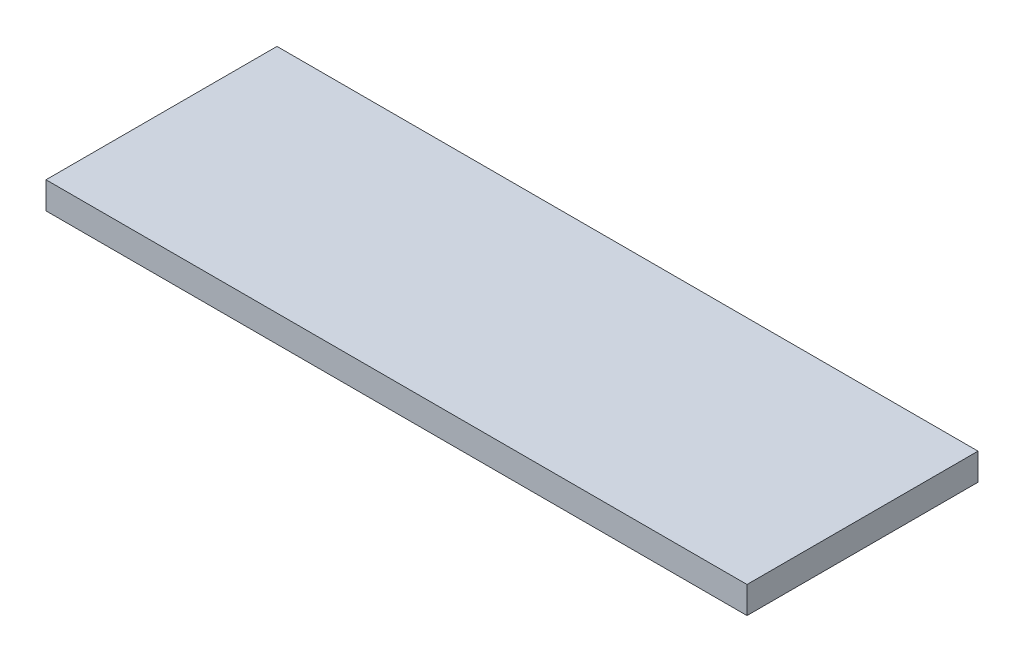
ISO-10303-21;
HEADER;
FILE_DESCRIPTION(('STEP AP214'),'2;1');
FILE_NAME('part.step','',(''),(''),'','','');
FILE_SCHEMA(('AUTOMOTIVE_DESIGN { 1 0 10303 214 1 1 1 1 }'));
ENDSEC;
DATA;
#1=APPLICATION_CONTEXT('core data for automotive mechanical design processes');
#2=APPLICATION_PROTOCOL_DEFINITION('international standard','automotive_design',2000,#1);
#3=PRODUCT_CONTEXT('',#1,'mechanical');
#4=PRODUCT('Part','Part','',(#3));
#5=PRODUCT_RELATED_PRODUCT_CATEGORY('part','',(#4));
#6=PRODUCT_DEFINITION_FORMATION('','',#4);
#7=PRODUCT_DEFINITION_CONTEXT('part definition',#1,'design');
#8=PRODUCT_DEFINITION('design','',#6,#7);
#9=PRODUCT_DEFINITION_SHAPE('','',#8);
#10=(LENGTH_UNIT() NAMED_UNIT(*) SI_UNIT(.MILLI.,.METRE.));
#11=(NAMED_UNIT(*) PLANE_ANGLE_UNIT() SI_UNIT($,.RADIAN.));
#12=(NAMED_UNIT(*) SI_UNIT($,.STERADIAN.) SOLID_ANGLE_UNIT());
#13=UNCERTAINTY_MEASURE_WITH_UNIT(LENGTH_MEASURE(1.E-05),#10,'distance_accuracy_value','');
#14=(GEOMETRIC_REPRESENTATION_CONTEXT(3) GLOBAL_UNCERTAINTY_ASSIGNED_CONTEXT((#13)) GLOBAL_UNIT_ASSIGNED_CONTEXT((#10,
#11,#12)) REPRESENTATION_CONTEXT('',''));
#15=CARTESIAN_POINT('',(0.,0.,0.));
#16=DIRECTION('',(0.,0.,1.));
#17=DIRECTION('',(1.,0.,0.));
#18=AXIS2_PLACEMENT_3D('',#15,#16,#17);
#19=CARTESIAN_POINT('',(0.,6.35,0.));
#20=DIRECTION('',(1.,0.,0.));
#21=DIRECTION('',(0.,0.,-1.));
#22=AXIS2_PLACEMENT_3D('',#19,#20,#21);
#23=PLANE('',#22);
#24=DIRECTION('',(0.,0.,1.));
#25=VECTOR('',#24,1.);
#26=CARTESIAN_POINT('',(0.,0.,0.));
#27=LINE('',#26,#25);
#28=CARTESIAN_POINT('',(0.,0.,-54.4));
#29=VERTEX_POINT('',#28);
#30=CARTESIAN_POINT('',(0.,0.,0.));
#31=VERTEX_POINT('',#30);
#32=EDGE_CURVE('E105',#29,#31,#27,.T.);
#33=ORIENTED_EDGE('',*,*,#32,.T.);
#34=DIRECTION('',(0.,-1.,0.));
#35=VECTOR('',#34,1.);
#36=CARTESIAN_POINT('',(0.,6.35,0.));
#37=LINE('',#36,#35);
#38=CARTESIAN_POINT('',(0.,6.35,0.));
#39=VERTEX_POINT('',#38);
#40=EDGE_CURVE('E11',#39,#31,#37,.T.);
#41=ORIENTED_EDGE('',*,*,#40,.F.);
#42=DIRECTION('',(0.,0.,1.));
#43=VECTOR('',#42,1.);
#44=CARTESIAN_POINT('',(0.,6.35,0.));
#45=LINE('',#44,#43);
#46=CARTESIAN_POINT('',(0.,6.35,-54.4));
#47=VERTEX_POINT('',#46);
#48=EDGE_CURVE('E89',#47,#39,#45,.T.);
#49=ORIENTED_EDGE('',*,*,#48,.F.);
#50=DIRECTION('',(0.,-1.,0.));
#51=VECTOR('',#50,1.);
#52=CARTESIAN_POINT('',(0.,6.35,-54.4));
#53=LINE('',#52,#51);
#54=EDGE_CURVE('E97',#47,#29,#53,.T.);
#55=ORIENTED_EDGE('',*,*,#54,.T.);
#56=EDGE_LOOP('',(#33,#41,#49,#55));
#57=FACE_BOUND('',#56,.T.);
#58=ADVANCED_FACE('F39',(#57),#23,.F.);
#59=CARTESIAN_POINT('',(0.,6.35,0.));
#60=DIRECTION('',(0.,0.,-1.));
#61=DIRECTION('',(-1.,0.,0.));
#62=AXIS2_PLACEMENT_3D('',#59,#60,#61);
#63=PLANE('',#62);
#64=DIRECTION('',(1.,0.,0.));
#65=VECTOR('',#64,1.);
#66=CARTESIAN_POINT('',(0.,0.,0.));
#67=LINE('',#66,#65);
#68=CARTESIAN_POINT('',(165.1,0.,0.));
#69=VERTEX_POINT('',#68);
#70=EDGE_CURVE('E92',#31,#69,#67,.T.);
#71=ORIENTED_EDGE('',*,*,#70,.T.);
#72=DIRECTION('',(0.,-1.,0.));
#73=VECTOR('',#72,1.);
#74=CARTESIAN_POINT('',(165.1,6.35,0.));
#75=LINE('',#74,#73);
#76=CARTESIAN_POINT('',(165.1,6.35,0.));
#77=VERTEX_POINT('',#76);
#78=EDGE_CURVE('E50',#77,#69,#75,.T.);
#79=ORIENTED_EDGE('',*,*,#78,.F.);
#80=DIRECTION('',(1.,0.,0.));
#81=VECTOR('',#80,1.);
#82=CARTESIAN_POINT('',(0.,6.35,0.));
#83=LINE('',#82,#81);
#84=EDGE_CURVE('E82',#39,#77,#83,.T.);
#85=ORIENTED_EDGE('',*,*,#84,.F.);
#86=ORIENTED_EDGE('',*,*,#40,.T.);
#87=EDGE_LOOP('',(#71,#79,#85,#86));
#88=FACE_BOUND('',#87,.T.);
#89=ADVANCED_FACE('F93',(#88),#63,.F.);
#90=CARTESIAN_POINT('',(165.1,6.35,0.));
#91=DIRECTION('',(-1.,0.,0.));
#92=DIRECTION('',(0.,0.,1.));
#93=AXIS2_PLACEMENT_3D('',#90,#91,#92);
#94=PLANE('',#93);
#95=DIRECTION('',(0.,0.,-1.));
#96=VECTOR('',#95,1.);
#97=CARTESIAN_POINT('',(165.1,0.,0.));
#98=LINE('',#97,#96);
#99=CARTESIAN_POINT('',(165.1,0.,-54.4));
#100=VERTEX_POINT('',#99);
#101=EDGE_CURVE('E72',#69,#100,#98,.T.);
#102=ORIENTED_EDGE('',*,*,#101,.T.);
#103=DIRECTION('',(0.,-1.,0.));
#104=VECTOR('',#103,1.);
#105=CARTESIAN_POINT('',(165.1,6.35,-54.4));
#106=LINE('',#105,#104);
#107=CARTESIAN_POINT('',(165.1,6.35,-54.4));
#108=VERTEX_POINT('',#107);
#109=EDGE_CURVE('E94',#108,#100,#106,.T.);
#110=ORIENTED_EDGE('',*,*,#109,.F.);
#111=DIRECTION('',(0.,0.,-1.));
#112=VECTOR('',#111,1.);
#113=CARTESIAN_POINT('',(165.1,6.35,0.));
#114=LINE('',#113,#112);
#115=EDGE_CURVE('E88',#77,#108,#114,.T.);
#116=ORIENTED_EDGE('',*,*,#115,.F.);
#117=ORIENTED_EDGE('',*,*,#78,.T.);
#118=EDGE_LOOP('',(#102,#110,#116,#117));
#119=FACE_BOUND('',#118,.T.);
#120=ADVANCED_FACE('F96',(#119),#94,.F.);
#121=CARTESIAN_POINT('',(0.,6.35,-54.4));
#122=DIRECTION('',(0.,0.,1.));
#123=DIRECTION('',(1.,0.,0.));
#124=AXIS2_PLACEMENT_3D('',#121,#122,#123);
#125=PLANE('',#124);
#126=DIRECTION('',(-1.,0.,0.));
#127=VECTOR('',#126,1.);
#128=CARTESIAN_POINT('',(0.,0.,-54.4));
#129=LINE('',#128,#127);
#130=EDGE_CURVE('E76',#100,#29,#129,.T.);
#131=ORIENTED_EDGE('',*,*,#130,.T.);
#132=ORIENTED_EDGE('',*,*,#54,.F.);
#133=DIRECTION('',(-1.,0.,0.));
#134=VECTOR('',#133,1.);
#135=CARTESIAN_POINT('',(0.,6.35,-54.4));
#136=LINE('',#135,#134);
#137=EDGE_CURVE('E54',#108,#47,#136,.T.);
#138=ORIENTED_EDGE('',*,*,#137,.F.);
#139=ORIENTED_EDGE('',*,*,#109,.T.);
#140=EDGE_LOOP('',(#131,#132,#138,#139));
#141=FACE_BOUND('',#140,.T.);
#142=ADVANCED_FACE('F108',(#141),#125,.F.);
#143=CARTESIAN_POINT('',(0.,6.35,0.));
#144=DIRECTION('',(0.,-1.,0.));
#145=DIRECTION('',(0.,0.,-1.));
#146=AXIS2_PLACEMENT_3D('',#143,#144,#145);
#147=PLANE('',#146);
#148=ORIENTED_EDGE('',*,*,#48,.T.);
#149=ORIENTED_EDGE('',*,*,#84,.T.);
#150=ORIENTED_EDGE('',*,*,#115,.T.);
#151=ORIENTED_EDGE('',*,*,#137,.T.);
#152=EDGE_LOOP('',(#148,#149,#150,#151));
#153=FACE_BOUND('',#152,.T.);
#154=ADVANCED_FACE('F86',(#153),#147,.F.);
#155=CARTESIAN_POINT('',(0.,0.,0.));
#156=DIRECTION('',(0.,-1.,0.));
#157=DIRECTION('',(0.,0.,-1.));
#158=AXIS2_PLACEMENT_3D('',#155,#156,#157);
#159=PLANE('',#158);
#160=ORIENTED_EDGE('',*,*,#32,.F.);
#161=ORIENTED_EDGE('',*,*,#130,.F.);
#162=ORIENTED_EDGE('',*,*,#101,.F.);
#163=ORIENTED_EDGE('',*,*,#70,.F.);
#164=EDGE_LOOP('',(#160,#161,#162,#163));
#165=FACE_BOUND('',#164,.T.);
#166=ADVANCED_FACE('F115',(#165),#159,.T.);
#167=CLOSED_SHELL('',(#58,#89,#120,#142,#154,#166));
#168=MANIFOLD_SOLID_BREP('B2',#167);
#169=ADVANCED_BREP_SHAPE_REPRESENTATION('',(#18,#168),#14);
#170=SHAPE_DEFINITION_REPRESENTATION(#9,#169);
ENDSEC;
END-ISO-10303-21;
